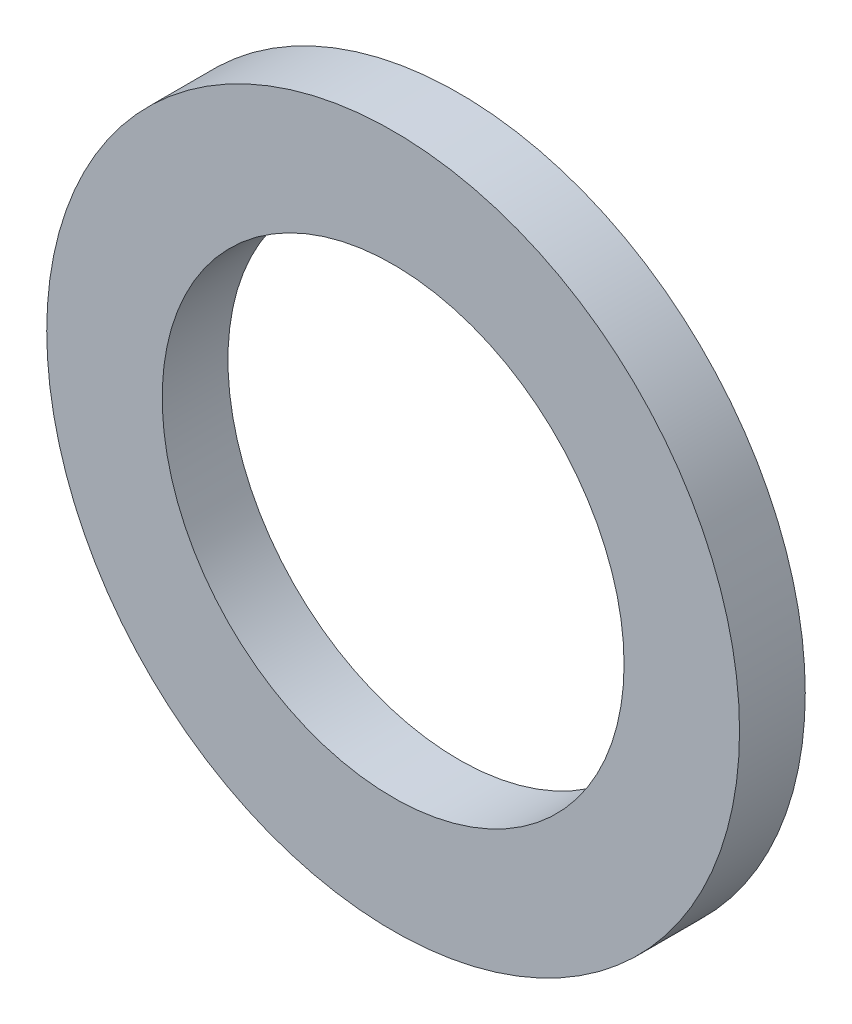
ISO-10303-21;
HEADER;
FILE_DESCRIPTION(('STEP AP214'),'2;1');
FILE_NAME('part.step','',(''),(''),'','','');
FILE_SCHEMA(('AUTOMOTIVE_DESIGN { 1 0 10303 214 1 1 1 1 }'));
ENDSEC;
DATA;
#1=APPLICATION_CONTEXT('core data for automotive mechanical design processes');
#2=APPLICATION_PROTOCOL_DEFINITION('international standard','automotive_design',2000,#1);
#3=PRODUCT_CONTEXT('',#1,'mechanical');
#4=PRODUCT('Part','Part','',(#3));
#5=PRODUCT_RELATED_PRODUCT_CATEGORY('part','',(#4));
#6=PRODUCT_DEFINITION_FORMATION('','',#4);
#7=PRODUCT_DEFINITION_CONTEXT('part definition',#1,'design');
#8=PRODUCT_DEFINITION('design','',#6,#7);
#9=PRODUCT_DEFINITION_SHAPE('','',#8);
#10=(LENGTH_UNIT() NAMED_UNIT(*) SI_UNIT(.MILLI.,.METRE.));
#11=(NAMED_UNIT(*) PLANE_ANGLE_UNIT() SI_UNIT($,.RADIAN.));
#12=(NAMED_UNIT(*) SI_UNIT($,.STERADIAN.) SOLID_ANGLE_UNIT());
#13=UNCERTAINTY_MEASURE_WITH_UNIT(LENGTH_MEASURE(1.E-05),#10,'distance_accuracy_value','');
#14=(GEOMETRIC_REPRESENTATION_CONTEXT(3) GLOBAL_UNCERTAINTY_ASSIGNED_CONTEXT((#13)) GLOBAL_UNIT_ASSIGNED_CONTEXT((#10,
#11,#12)) REPRESENTATION_CONTEXT('',''));
#15=CARTESIAN_POINT('',(0.,0.,0.));
#16=DIRECTION('',(0.,0.,1.));
#17=DIRECTION('',(1.,0.,0.));
#18=AXIS2_PLACEMENT_3D('',#15,#16,#17);
#19=CARTESIAN_POINT('',(0.,0.,1.85));
#20=DIRECTION('',(0.,0.,1.));
#21=DIRECTION('',(1.,0.,0.));
#22=AXIS2_PLACEMENT_3D('',#19,#20,#21);
#23=PLANE('',#22);
#24=CARTESIAN_POINT('',(0.,0.,1.85));
#25=DIRECTION('',(0.,0.,1.));
#26=DIRECTION('',(1.,0.,0.));
#27=AXIS2_PLACEMENT_3D('',#24,#25,#26);
#28=CIRCLE('',#27,19.5);
#29=CARTESIAN_POINT('',(19.5,0.,1.85));
#30=VERTEX_POINT('',#29);
#31=EDGE_CURVE('E10',#30,#30,#28,.T.);
#32=ORIENTED_EDGE('',*,*,#31,.T.);
#33=EDGE_LOOP('',(#32));
#34=FACE_BOUND('',#33,.T.);
#35=CARTESIAN_POINT('',(0.,0.,1.85));
#36=DIRECTION('',(0.,0.,1.));
#37=DIRECTION('',(1.,0.,0.));
#38=AXIS2_PLACEMENT_3D('',#35,#36,#37);
#39=CIRCLE('',#38,13.);
#40=CARTESIAN_POINT('',(13.,0.,1.85));
#41=VERTEX_POINT('',#40);
#42=EDGE_CURVE('E40',#41,#41,#39,.T.);
#43=ORIENTED_EDGE('',*,*,#42,.F.);
#44=EDGE_LOOP('',(#43));
#45=FACE_BOUND('',#44,.T.);
#46=ADVANCED_FACE('F29',(#34,#45),#23,.T.);
#47=CARTESIAN_POINT('',(0.,0.,-1.85));
#48=DIRECTION('',(0.,0.,1.));
#49=DIRECTION('',(1.,0.,0.));
#50=AXIS2_PLACEMENT_3D('',#47,#48,#49);
#51=PLANE('',#50);
#52=CARTESIAN_POINT('',(0.,0.,-1.85));
#53=DIRECTION('',(0.,0.,1.));
#54=DIRECTION('',(1.,0.,0.));
#55=AXIS2_PLACEMENT_3D('',#52,#53,#54);
#56=CIRCLE('',#55,19.5);
#57=CARTESIAN_POINT('',(19.5,0.,-1.85));
#58=VERTEX_POINT('',#57);
#59=EDGE_CURVE('E36',#58,#58,#56,.T.);
#60=ORIENTED_EDGE('',*,*,#59,.F.);
#61=EDGE_LOOP('',(#60));
#62=FACE_BOUND('',#61,.T.);
#63=CARTESIAN_POINT('',(0.,0.,-1.85));
#64=DIRECTION('',(0.,0.,1.));
#65=DIRECTION('',(1.,0.,0.));
#66=AXIS2_PLACEMENT_3D('',#63,#64,#65);
#67=CIRCLE('',#66,13.);
#68=CARTESIAN_POINT('',(13.,0.,-1.85));
#69=VERTEX_POINT('',#68);
#70=EDGE_CURVE('E44',#69,#69,#67,.T.);
#71=ORIENTED_EDGE('',*,*,#70,.T.);
#72=EDGE_LOOP('',(#71));
#73=FACE_BOUND('',#72,.T.);
#74=ADVANCED_FACE('F50',(#62,#73),#51,.F.);
#75=CARTESIAN_POINT('',(0.,0.,1.85));
#76=DIRECTION('',(0.,0.,-1.));
#77=DIRECTION('',(-1.,0.,0.));
#78=AXIS2_PLACEMENT_3D('',#75,#76,#77);
#79=CYLINDRICAL_SURFACE('',#78,19.5);
#80=ORIENTED_EDGE('',*,*,#31,.F.);
#81=EDGE_LOOP('',(#80));
#82=FACE_BOUND('',#81,.T.);
#83=ORIENTED_EDGE('',*,*,#59,.T.);
#84=EDGE_LOOP('',(#83));
#85=FACE_BOUND('',#84,.T.);
#86=ADVANCED_FACE('F31',(#82,#85),#79,.T.);
#87=CARTESIAN_POINT('',(0.,0.,1.85));
#88=DIRECTION('',(0.,0.,-1.));
#89=DIRECTION('',(-1.,0.,0.));
#90=AXIS2_PLACEMENT_3D('',#87,#88,#89);
#91=CYLINDRICAL_SURFACE('',#90,13.);
#92=ORIENTED_EDGE('',*,*,#42,.T.);
#93=EDGE_LOOP('',(#92));
#94=FACE_BOUND('',#93,.T.);
#95=ORIENTED_EDGE('',*,*,#70,.F.);
#96=EDGE_LOOP('',(#95));
#97=FACE_BOUND('',#96,.T.);
#98=ADVANCED_FACE('F52',(#94,#97),#91,.F.);
#99=CLOSED_SHELL('',(#46,#74,#86,#98));
#100=MANIFOLD_SOLID_BREP('B2',#99);
#101=ADVANCED_BREP_SHAPE_REPRESENTATION('',(#18,#100),#14);
#102=SHAPE_DEFINITION_REPRESENTATION(#9,#101);
ENDSEC;
END-ISO-10303-21;
